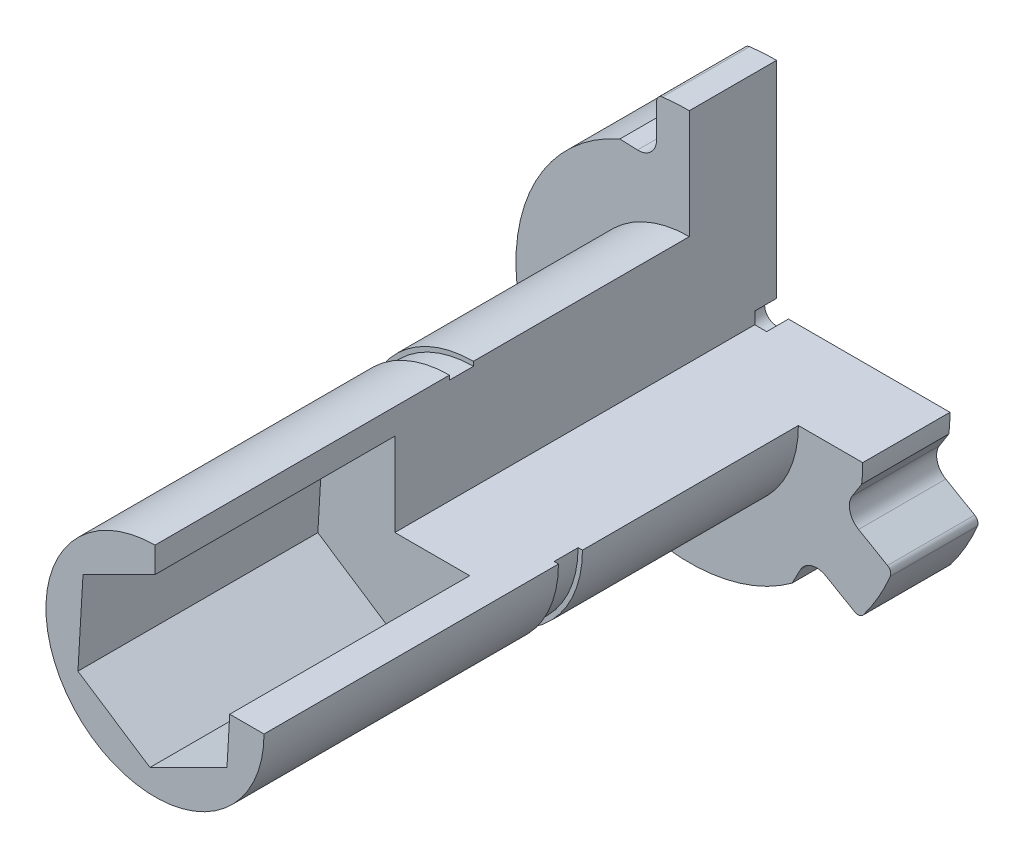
ISO-10303-21;
HEADER;
FILE_DESCRIPTION(('STEP AP214'),'2;1');
FILE_NAME('part.step','',(''),(''),'','','');
FILE_SCHEMA(('AUTOMOTIVE_DESIGN { 1 0 10303 214 1 1 1 1 }'));
ENDSEC;
DATA;
#1=APPLICATION_CONTEXT('core data for automotive mechanical design processes');
#2=APPLICATION_PROTOCOL_DEFINITION('international standard','automotive_design',2000,#1);
#3=PRODUCT_CONTEXT('',#1,'mechanical');
#4=PRODUCT('Part','Part','',(#3));
#5=PRODUCT_RELATED_PRODUCT_CATEGORY('part','',(#4));
#6=PRODUCT_DEFINITION_FORMATION('','',#4);
#7=PRODUCT_DEFINITION_CONTEXT('part definition',#1,'design');
#8=PRODUCT_DEFINITION('design','',#6,#7);
#9=PRODUCT_DEFINITION_SHAPE('','',#8);
#10=(LENGTH_UNIT() NAMED_UNIT(*) SI_UNIT(.MILLI.,.METRE.));
#11=(NAMED_UNIT(*) PLANE_ANGLE_UNIT() SI_UNIT($,.RADIAN.));
#12=(NAMED_UNIT(*) SI_UNIT($,.STERADIAN.) SOLID_ANGLE_UNIT());
#13=UNCERTAINTY_MEASURE_WITH_UNIT(LENGTH_MEASURE(1.E-05),#10,'distance_accuracy_value','');
#14=(GEOMETRIC_REPRESENTATION_CONTEXT(3) GLOBAL_UNCERTAINTY_ASSIGNED_CONTEXT((#13)) GLOBAL_UNIT_ASSIGNED_CONTEXT((#10,
#11,#12)) REPRESENTATION_CONTEXT('',''));
#15=CARTESIAN_POINT('',(0.,0.,0.));
#16=DIRECTION('',(0.,0.,1.));
#17=DIRECTION('',(1.,0.,0.));
#18=AXIS2_PLACEMENT_3D('',#15,#16,#17);
#19=CARTESIAN_POINT('',(0.,0.,24.5));
#20=DIRECTION('',(0.,0.,-1.));
#21=DIRECTION('',(-1.,0.,0.));
#22=AXIS2_PLACEMENT_3D('',#19,#20,#21);
#23=CYLINDRICAL_SURFACE('',#22,5.);
#24=DIRECTION('',(0.,0.,-1.));
#25=VECTOR('',#24,1.);
#26=CARTESIAN_POINT('',(5.,0.,24.5));
#27=LINE('',#26,#25);
#28=CARTESIAN_POINT('',(5.,0.,9.9));
#29=VERTEX_POINT('',#28);
#30=CARTESIAN_POINT('',(5.,0.,0.));
#31=VERTEX_POINT('',#30);
#32=EDGE_CURVE('E420',#29,#31,#27,.T.);
#33=ORIENTED_EDGE('',*,*,#32,.F.);
#34=CARTESIAN_POINT('',(0.,0.,9.9));
#35=DIRECTION('',(0.,0.,1.));
#36=DIRECTION('',(1.,0.,0.));
#37=AXIS2_PLACEMENT_3D('',#34,#35,#36);
#38=CIRCLE('',#37,5.);
#39=CARTESIAN_POINT('',(0.,5.,9.9));
#40=VERTEX_POINT('',#39);
#41=EDGE_CURVE('E442',#40,#29,#38,.T.);
#42=ORIENTED_EDGE('',*,*,#41,.F.);
#43=DIRECTION('',(0.,0.,-1.));
#44=VECTOR('',#43,1.);
#45=CARTESIAN_POINT('',(0.,5.,24.5));
#46=LINE('',#45,#44);
#47=CARTESIAN_POINT('',(0.,5.,0.));
#48=VERTEX_POINT('',#47);
#49=EDGE_CURVE('E700',#48,#40,#46,.F.);
#50=ORIENTED_EDGE('',*,*,#49,.F.);
#51=CARTESIAN_POINT('',(0.,0.,0.));
#52=DIRECTION('',(0.,0.,-1.));
#53=DIRECTION('',(-1.,0.,0.));
#54=AXIS2_PLACEMENT_3D('',#51,#52,#53);
#55=CIRCLE('',#54,5.);
#56=EDGE_CURVE('E585',#31,#48,#55,.T.);
#57=ORIENTED_EDGE('',*,*,#56,.F.);
#58=EDGE_LOOP('',(#33,#42,#50,#57));
#59=FACE_BOUND('',#58,.T.);
#60=ADVANCED_FACE('F115',(#59),#23,.T.);
#61=CARTESIAN_POINT('',(0.,0.,0.));
#62=DIRECTION('',(0.,0.,-1.));
#63=DIRECTION('',(-1.,0.,0.));
#64=AXIS2_PLACEMENT_3D('',#61,#62,#63);
#65=PLANE('',#64);
#66=DIRECTION('',(1.,0.,0.));
#67=VECTOR('',#66,1.);
#68=CARTESIAN_POINT('',(0.,0.,0.));
#69=LINE('',#68,#67);
#70=CARTESIAN_POINT('',(7.95,0.,0.));
#71=VERTEX_POINT('',#70);
#72=EDGE_CURVE('E422',#31,#71,#69,.T.);
#73=ORIENTED_EDGE('',*,*,#72,.F.);
#74=ORIENTED_EDGE('',*,*,#56,.T.);
#75=DIRECTION('',(0.,-1.,0.));
#76=VECTOR('',#75,1.);
#77=CARTESIAN_POINT('',(0.,0.,0.));
#78=LINE('',#77,#76);
#79=CARTESIAN_POINT('',(0.,10.,0.));
#80=VERTEX_POINT('',#79);
#81=EDGE_CURVE('E736',#80,#48,#78,.T.);
#82=ORIENTED_EDGE('',*,*,#81,.F.);
#83=CARTESIAN_POINT('',(0.,0.,0.));
#84=DIRECTION('',(0.,0.,-1.));
#85=DIRECTION('',(-1.,0.,0.));
#86=AXIS2_PLACEMENT_3D('',#83,#84,#85);
#87=CIRCLE('',#86,10.);
#88=CARTESIAN_POINT('',(-1.23711340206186,9.92318247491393,0.));
#89=VERTEX_POINT('',#88);
#90=EDGE_CURVE('E581',#89,#80,#87,.T.);
#91=ORIENTED_EDGE('',*,*,#90,.F.);
#92=CARTESIAN_POINT('',(-1.2,9.62548700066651,0.));
#93=DIRECTION('',(0.,0.,-1.));
#94=DIRECTION('',(-1.,0.,0.));
#95=AXIS2_PLACEMENT_3D('',#92,#93,#94);
#96=CIRCLE('',#95,0.3);
#97=CARTESIAN_POINT('',(-1.5,9.62548700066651,0.));
#98=VERTEX_POINT('',#97);
#99=EDGE_CURVE('E645',#89,#98,#96,.F.);
#100=ORIENTED_EDGE('',*,*,#99,.T.);
#101=DIRECTION('',(0.,-1.,0.));
#102=VECTOR('',#101,1.);
#103=CARTESIAN_POINT('',(-1.5,0.,0.));
#104=LINE('',#103,#102);
#105=CARTESIAN_POINT('',(-1.5,8.09309769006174,0.));
#106=VERTEX_POINT('',#105);
#107=EDGE_CURVE('E559',#98,#106,#104,.T.);
#108=ORIENTED_EDGE('',*,*,#107,.T.);
#109=CARTESIAN_POINT('',(-2.34249622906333,8.09309769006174,0.));
#110=DIRECTION('',(0.,0.,-1.));
#111=DIRECTION('',(-1.,0.,0.));
#112=AXIS2_PLACEMENT_3D('',#109,#110,#111);
#113=CIRCLE('',#112,0.842496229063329);
#114=CARTESIAN_POINT('',(-2.37659488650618,7.25129178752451,0.));
#115=VERTEX_POINT('',#114);
#116=EDGE_CURVE('E556',#106,#115,#113,.T.);
#117=ORIENTED_EDGE('',*,*,#116,.T.);
#118=DIRECTION('',(-0.999180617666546,0.0404733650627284,0.));
#119=VECTOR('',#118,1.);
#120=CARTESIAN_POINT('',(0.289350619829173,7.1433035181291,0.));
#121=LINE('',#120,#119);
#122=CARTESIAN_POINT('',(-3.18515413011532,7.28404373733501,0.));
#123=VERTEX_POINT('',#122);
#124=EDGE_CURVE('E553',#115,#123,#121,.T.);
#125=ORIENTED_EDGE('',*,*,#124,.T.);
#126=CARTESIAN_POINT('',(0.,0.,0.));
#127=DIRECTION('',(0.,0.,-1.));
#128=DIRECTION('',(-1.,0.,0.));
#129=AXIS2_PLACEMENT_3D('',#126,#127,#128);
#130=CIRCLE('',#129,7.95);
#131=CARTESIAN_POINT('',(-7.90074398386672,-0.883597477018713,0.));
#132=VERTEX_POINT('',#131);
#133=EDGE_CURVE('E551',#132,#123,#130,.T.);
#134=ORIENTED_EDGE('',*,*,#133,.F.);
#135=DIRECTION('',(-0.534641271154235,0.845079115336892,0.));
#136=VECTOR('',#135,1.);
#137=CARTESIAN_POINT('',(-6.04160700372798,-3.82223674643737,0.));
#138=LINE('',#137,#136);
#139=CARTESIAN_POINT('',(-7.46810034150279,-1.5674543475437,0.));
#140=VERTEX_POINT('',#139);
#141=EDGE_CURVE('E549',#140,#132,#138,.T.);
#142=ORIENTED_EDGE('',*,*,#141,.F.);
#143=CARTESIAN_POINT('',(-8.18007630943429,-2.01788760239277,0.));
#144=DIRECTION('',(0.,0.,-1.));
#145=DIRECTION('',(-1.,0.,0.));
#146=AXIS2_PLACEMENT_3D('',#143,#144,#145);
#147=CIRCLE('',#146,0.842496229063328);
#148=CARTESIAN_POINT('',(-7.75882819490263,-2.74751073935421,0.));
#149=VERTEX_POINT('',#148);
#150=EDGE_CURVE('E547',#149,#140,#147,.F.);
#151=ORIENTED_EDGE('',*,*,#150,.F.);
#152=DIRECTION('',(0.866025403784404,0.50000000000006,0.));
#153=VECTOR('',#152,1.);
#154=CARTESIAN_POINT('',(-0.750000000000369,1.29903810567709,0.));
#155=LINE('',#154,#153);
#156=CARTESIAN_POINT('',(-9.08591626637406,-3.51370539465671,0.));
#157=VERTEX_POINT('',#156);
#158=EDGE_CURVE('E545',#157,#149,#155,.T.);
#159=ORIENTED_EDGE('',*,*,#158,.F.);
#160=CARTESIAN_POINT('',(-8.93591626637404,-3.77351301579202,0.));
#161=DIRECTION('',(0.,0.,-1.));
#162=DIRECTION('',(-1.,0.,0.));
#163=AXIS2_PLACEMENT_3D('',#160,#161,#162);
#164=CIRCLE('',#163,0.3);
#165=CARTESIAN_POINT('',(-9.21228481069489,-3.8902196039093,0.));
#166=VERTEX_POINT('',#165);
#167=EDGE_CURVE('E651',#157,#166,#164,.F.);
#168=ORIENTED_EDGE('',*,*,#167,.T.);
#169=CARTESIAN_POINT('',(-7.97517140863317,-6.0329628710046,0.));
#170=VERTEX_POINT('',#169);
#171=EDGE_CURVE('E577',#170,#166,#87,.T.);
#172=ORIENTED_EDGE('',*,*,#171,.F.);
#173=CARTESIAN_POINT('',(-7.73591626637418,-5.85197398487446,0.));
#174=DIRECTION('',(0.,0.,-1.));
#175=DIRECTION('',(-1.,0.,0.));
#176=AXIS2_PLACEMENT_3D('',#173,#174,#175);
#177=CIRCLE('',#176,0.3);
#178=CARTESIAN_POINT('',(-7.58591626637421,-6.1117816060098,0.));
#179=VERTEX_POINT('',#178);
#180=EDGE_CURVE('E649',#170,#179,#177,.F.);
#181=ORIENTED_EDGE('',*,*,#180,.T.);
#182=DIRECTION('',(0.866025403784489,0.499999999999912,0.));
#183=VECTOR('',#182,1.);
#184=CARTESIAN_POINT('',(0.750000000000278,-1.29903810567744,0.));
#185=LINE('',#184,#183);
#186=CARTESIAN_POINT('',(-6.25882819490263,-5.34558695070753,0.));
#187=VERTEX_POINT('',#186);
#188=EDGE_CURVE('E543',#179,#187,#185,.T.);
#189=ORIENTED_EDGE('',*,*,#188,.T.);
#190=CARTESIAN_POINT('',(-5.83758008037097,-6.07521008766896,0.));
#191=DIRECTION('',(0.,0.,-1.));
#192=DIRECTION('',(-1.,0.,0.));
#193=AXIS2_PLACEMENT_3D('',#190,#191,#192);
#194=CIRCLE('',#193,0.842496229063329);
#195=CARTESIAN_POINT('',(-5.09150545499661,-5.68383743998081,0.));
#196=VERTEX_POINT('',#195);
#197=EDGE_CURVE('E540',#187,#196,#194,.T.);
#198=ORIENTED_EDGE('',*,*,#197,.T.);
#199=DIRECTION('',(0.464539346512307,-0.88555248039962,0.));
#200=VECTOR('',#199,1.);
#201=CARTESIAN_POINT('',(-6.33095762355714,-3.3210667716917,0.));
#202=LINE('',#201,#200);
#203=CARTESIAN_POINT('',(-4.71558985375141,-6.4004462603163,0.));
#204=VERTEX_POINT('',#203);
#205=EDGE_CURVE('E537',#196,#204,#202,.T.);
#206=ORIENTED_EDGE('',*,*,#205,.T.);
#207=CARTESIAN_POINT('',(0.,0.,0.));
#208=DIRECTION('',(0.,0.,-1.));
#209=DIRECTION('',(-1.,0.,0.));
#210=AXIS2_PLACEMENT_3D('',#207,#208,#209);
#211=CIRCLE('',#210,7.95);
#212=CARTESIAN_POINT('',(4.7155898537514,-6.40044626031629,0.));
#213=VERTEX_POINT('',#212);
#214=EDGE_CURVE('E501',#213,#204,#211,.T.);
#215=ORIENTED_EDGE('',*,*,#214,.F.);
#216=DIRECTION('',(-0.464539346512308,-0.885552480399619,0.));
#217=VECTOR('',#216,1.);
#218=CARTESIAN_POINT('',(6.33095762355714,-3.32106677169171,0.));
#219=LINE('',#218,#217);
#220=CARTESIAN_POINT('',(5.0915054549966,-5.68383743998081,0.));
#221=VERTEX_POINT('',#220);
#222=EDGE_CURVE('E575',#221,#213,#219,.T.);
#223=ORIENTED_EDGE('',*,*,#222,.F.);
#224=CARTESIAN_POINT('',(5.83758008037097,-6.07521008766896,0.));
#225=DIRECTION('',(0.,0.,-1.));
#226=DIRECTION('',(-1.,0.,0.));
#227=AXIS2_PLACEMENT_3D('',#224,#225,#226);
#228=CIRCLE('',#227,0.842496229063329);
#229=CARTESIAN_POINT('',(6.25882819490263,-5.34558695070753,0.));
#230=VERTEX_POINT('',#229);
#231=EDGE_CURVE('E573',#230,#221,#228,.F.);
#232=ORIENTED_EDGE('',*,*,#231,.F.);
#233=DIRECTION('',(-0.866025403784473,0.499999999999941,0.));
#234=VECTOR('',#233,1.);
#235=CARTESIAN_POINT('',(-0.750000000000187,-1.29903810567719,0.));
#236=LINE('',#235,#234);
#237=CARTESIAN_POINT('',(7.58591626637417,-6.11178160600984,0.));
#238=VERTEX_POINT('',#237);
#239=EDGE_CURVE('E571',#238,#230,#236,.T.);
#240=ORIENTED_EDGE('',*,*,#239,.F.);
#241=CARTESIAN_POINT('',(7.73591626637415,-5.8519739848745,0.));
#242=DIRECTION('',(0.,0.,-1.));
#243=DIRECTION('',(-1.,0.,0.));
#244=AXIS2_PLACEMENT_3D('',#241,#242,#243);
#245=CIRCLE('',#244,0.3);
#246=CARTESIAN_POINT('',(7.97517140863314,-6.03296287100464,0.));
#247=VERTEX_POINT('',#246);
#248=EDGE_CURVE('E647',#238,#247,#245,.F.);
#249=ORIENTED_EDGE('',*,*,#248,.T.);
#250=CARTESIAN_POINT('',(9.21228481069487,-3.89021960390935,0.));
#251=VERTEX_POINT('',#250);
#252=EDGE_CURVE('E580',#251,#247,#87,.T.);
#253=ORIENTED_EDGE('',*,*,#252,.F.);
#254=CARTESIAN_POINT('',(8.93591626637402,-3.77351301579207,0.));
#255=DIRECTION('',(0.,0.,-1.));
#256=DIRECTION('',(-1.,0.,0.));
#257=AXIS2_PLACEMENT_3D('',#254,#255,#256);
#258=CIRCLE('',#257,0.3);
#259=CARTESIAN_POINT('',(9.08591626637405,-3.51370539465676,0.));
#260=VERTEX_POINT('',#259);
#261=EDGE_CURVE('E653',#251,#260,#258,.F.);
#262=ORIENTED_EDGE('',*,*,#261,.T.);
#263=DIRECTION('',(-0.866025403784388,0.500000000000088,0.));
#264=VECTOR('',#263,1.);
#265=CARTESIAN_POINT('',(0.750000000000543,1.29903810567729,0.));
#266=LINE('',#265,#264);
#267=CARTESIAN_POINT('',(7.75882819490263,-2.74751073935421,0.));
#268=VERTEX_POINT('',#267);
#269=EDGE_CURVE('E569',#260,#268,#266,.T.);
#270=ORIENTED_EDGE('',*,*,#269,.T.);
#271=CARTESIAN_POINT('',(8.18007630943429,-2.01788760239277,0.));
#272=DIRECTION('',(0.,0.,-1.));
#273=DIRECTION('',(-1.,0.,0.));
#274=AXIS2_PLACEMENT_3D('',#271,#272,#273);
#275=CIRCLE('',#274,0.842496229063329);
#276=CARTESIAN_POINT('',(7.46810034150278,-1.56745434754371,0.));
#277=VERTEX_POINT('',#276);
#278=EDGE_CURVE('E566',#268,#277,#275,.T.);
#279=ORIENTED_EDGE('',*,*,#278,.T.);
#280=DIRECTION('',(0.53464127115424,0.845079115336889,0.));
#281=VECTOR('',#280,1.);
#282=CARTESIAN_POINT('',(6.04160700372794,-3.8222367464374,0.));
#283=LINE('',#282,#281);
#284=CARTESIAN_POINT('',(7.90074398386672,-0.883597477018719,0.));
#285=VERTEX_POINT('',#284);
#286=EDGE_CURVE('E563',#277,#285,#283,.T.);
#287=ORIENTED_EDGE('',*,*,#286,.T.);
#288=CARTESIAN_POINT('',(0.,0.,0.));
#289=DIRECTION('',(0.,0.,-1.));
#290=DIRECTION('',(-1.,0.,0.));
#291=AXIS2_PLACEMENT_3D('',#288,#289,#290);
#292=CIRCLE('',#291,7.95);
#293=EDGE_CURVE('E561',#71,#285,#292,.T.);
#294=ORIENTED_EDGE('',*,*,#293,.F.);
#295=EDGE_LOOP('',(#73,#74,#82,#91,#100,#108,#117,#125,#134,#142,#151,#159,#168,#172,#181,#189,
#198,#206,#215,#223,#232,#240,#249,#253,#262,#270,#279,#287,#294));
#296=FACE_BOUND('',#295,.T.);
#297=ADVANCED_FACE('F704',(#296),#65,.F.);
#298=CARTESIAN_POINT('',(0.,0.,-4.));
#299=DIRECTION('',(0.,0.,1.));
#300=DIRECTION('',(1.,0.,0.));
#301=AXIS2_PLACEMENT_3D('',#298,#299,#300);
#302=CYLINDRICAL_SURFACE('',#301,10.);
#303=DIRECTION('',(0.,0.,1.));
#304=VECTOR('',#303,1.);
#305=CARTESIAN_POINT('',(0.,10.,-4.));
#306=LINE('',#305,#304);
#307=CARTESIAN_POINT('',(0.,10.,-4.));
#308=VERTEX_POINT('',#307);
#309=EDGE_CURVE('E734',#308,#80,#306,.T.);
#310=ORIENTED_EDGE('',*,*,#309,.F.);
#311=CARTESIAN_POINT('',(0.,0.,-4.));
#312=DIRECTION('',(0.,0.,-1.));
#313=DIRECTION('',(-1.,0.,0.));
#314=AXIS2_PLACEMENT_3D('',#311,#312,#313);
#315=CIRCLE('',#314,10.);
#316=CARTESIAN_POINT('',(-1.23711340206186,9.92318247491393,-4.));
#317=VERTEX_POINT('',#316);
#318=EDGE_CURVE('E582',#317,#308,#315,.T.);
#319=ORIENTED_EDGE('',*,*,#318,.F.);
#320=DIRECTION('',(0.,0.,1.));
#321=VECTOR('',#320,1.);
#322=CARTESIAN_POINT('',(-1.23711340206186,9.92318247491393,-4.));
#323=LINE('',#322,#321);
#324=EDGE_CURVE('E666',#317,#89,#323,.T.);
#325=ORIENTED_EDGE('',*,*,#324,.T.);
#326=ORIENTED_EDGE('',*,*,#90,.T.);
#327=EDGE_LOOP('',(#310,#319,#325,#326));
#328=FACE_BOUND('',#327,.T.);
#329=ADVANCED_FACE('F747',(#328),#302,.T.);
#330=CARTESIAN_POINT('',(0.,0.,-4.));
#331=DIRECTION('',(0.,0.,-1.));
#332=DIRECTION('',(-1.,0.,0.));
#333=AXIS2_PLACEMENT_3D('',#330,#331,#332);
#334=PLANE('',#333);
#335=CARTESIAN_POINT('',(0.,0.,-4.));
#336=DIRECTION('',(0.,0.,-1.));
#337=DIRECTION('',(-1.,0.,0.));
#338=AXIS2_PLACEMENT_3D('',#335,#336,#337);
#339=CIRCLE('',#338,0.545651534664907);
#340=CARTESIAN_POINT('',(0.545651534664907,0.,-4.));
#341=VERTEX_POINT('',#340);
#342=CARTESIAN_POINT('',(0.,0.545651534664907,-4.));
#343=VERTEX_POINT('',#342);
#344=EDGE_CURVE('E445',#341,#343,#339,.T.);
#345=ORIENTED_EDGE('',*,*,#344,.F.);
#346=DIRECTION('',(1.,0.,0.));
#347=VECTOR('',#346,1.);
#348=CARTESIAN_POINT('',(0.,0.,-4.));
#349=LINE('',#348,#347);
#350=CARTESIAN_POINT('',(7.95,0.,-4.));
#351=VERTEX_POINT('',#350);
#352=EDGE_CURVE('E427',#341,#351,#349,.T.);
#353=ORIENTED_EDGE('',*,*,#352,.T.);
#354=CARTESIAN_POINT('',(0.,0.,-4.));
#355=DIRECTION('',(0.,0.,-1.));
#356=DIRECTION('',(-1.,0.,0.));
#357=AXIS2_PLACEMENT_3D('',#354,#355,#356);
#358=CIRCLE('',#357,7.95);
#359=CARTESIAN_POINT('',(7.90074398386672,-0.883597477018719,-4.));
#360=VERTEX_POINT('',#359);
#361=EDGE_CURVE('E483',#351,#360,#358,.T.);
#362=ORIENTED_EDGE('',*,*,#361,.T.);
#363=DIRECTION('',(0.53464127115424,0.845079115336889,0.));
#364=VECTOR('',#363,1.);
#365=CARTESIAN_POINT('',(-0.287325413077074,-13.826044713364,-4.));
#366=LINE('',#365,#364);
#367=CARTESIAN_POINT('',(7.46810034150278,-1.56745434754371,-4.));
#368=VERTEX_POINT('',#367);
#369=EDGE_CURVE('E485',#368,#360,#366,.T.);
#370=ORIENTED_EDGE('',*,*,#369,.F.);
#371=CARTESIAN_POINT('',(8.18007630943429,-2.01788760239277,-4.));
#372=DIRECTION('',(0.,0.,-1.));
#373=DIRECTION('',(-1.,0.,0.));
#374=AXIS2_PLACEMENT_3D('',#371,#372,#373);
#375=CIRCLE('',#374,0.842496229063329);
#376=CARTESIAN_POINT('',(7.75882819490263,-2.74751073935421,-4.));
#377=VERTEX_POINT('',#376);
#378=EDGE_CURVE('E488',#377,#368,#375,.T.);
#379=ORIENTED_EDGE('',*,*,#378,.F.);
#380=DIRECTION('',(-0.866025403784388,0.500000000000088,0.));
#381=VECTOR('',#380,1.);
#382=CARTESIAN_POINT('',(-15.8560660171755,10.8865547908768,-4.));
#383=LINE('',#382,#381);
#384=CARTESIAN_POINT('',(9.08591626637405,-3.51370539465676,-4.));
#385=VERTEX_POINT('',#384);
#386=EDGE_CURVE('E491',#385,#377,#383,.T.);
#387=ORIENTED_EDGE('',*,*,#386,.F.);
#388=CARTESIAN_POINT('',(8.93591626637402,-3.77351301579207,-4.));
#389=DIRECTION('',(0.,0.,-1.));
#390=DIRECTION('',(-1.,0.,0.));
#391=AXIS2_PLACEMENT_3D('',#388,#389,#390);
#392=CIRCLE('',#391,0.3);
#393=CARTESIAN_POINT('',(9.21228481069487,-3.89021960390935,-4.));
#394=VERTEX_POINT('',#393);
#395=EDGE_CURVE('E638',#385,#394,#392,.T.);
#396=ORIENTED_EDGE('',*,*,#395,.T.);
#397=CARTESIAN_POINT('',(7.97517140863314,-6.03296287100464,-4.));
#398=VERTEX_POINT('',#397);
#399=EDGE_CURVE('E586',#394,#398,#315,.T.);
#400=ORIENTED_EDGE('',*,*,#399,.T.);
#401=CARTESIAN_POINT('',(7.73591626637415,-5.8519739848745,-4.));
#402=DIRECTION('',(0.,0.,-1.));
#403=DIRECTION('',(-1.,0.,0.));
#404=AXIS2_PLACEMENT_3D('',#401,#402,#403);
#405=CIRCLE('',#404,0.3);
#406=CARTESIAN_POINT('',(7.58591626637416,-6.11178160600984,-4.));
#407=VERTEX_POINT('',#406);
#408=EDGE_CURVE('E632',#398,#407,#405,.T.);
#409=ORIENTED_EDGE('',*,*,#408,.T.);
#410=DIRECTION('',(-0.866025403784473,0.499999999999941,0.));
#411=VECTOR('',#410,1.);
#412=CARTESIAN_POINT('',(-17.3560660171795,8.28847857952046,-4.));
#413=LINE('',#412,#411);
#414=CARTESIAN_POINT('',(6.25882819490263,-5.34558695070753,-4.));
#415=VERTEX_POINT('',#414);
#416=EDGE_CURVE('E493',#407,#415,#413,.T.);
#417=ORIENTED_EDGE('',*,*,#416,.T.);
#418=CARTESIAN_POINT('',(5.83758008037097,-6.07521008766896,-4.));
#419=DIRECTION('',(0.,0.,-1.));
#420=DIRECTION('',(-1.,0.,0.));
#421=AXIS2_PLACEMENT_3D('',#418,#419,#420);
#422=CIRCLE('',#421,0.842496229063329);
#423=CARTESIAN_POINT('',(5.0915054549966,-5.68383743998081,-4.));
#424=VERTEX_POINT('',#423);
#425=EDGE_CURVE('E495',#415,#424,#422,.F.);
#426=ORIENTED_EDGE('',*,*,#425,.T.);
#427=DIRECTION('',(-0.464539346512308,-0.885552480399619,0.));
#428=VECTOR('',#427,1.);
#429=CARTESIAN_POINT('',(1.55290964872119,-12.4294711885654,-4.));
#430=LINE('',#429,#428);
#431=CARTESIAN_POINT('',(4.7155898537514,-6.4004462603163,-4.));
#432=VERTEX_POINT('',#431);
#433=EDGE_CURVE('E451',#424,#432,#430,.T.);
#434=ORIENTED_EDGE('',*,*,#433,.T.);
#435=CARTESIAN_POINT('',(0.,0.,-4.));
#436=DIRECTION('',(0.,0.,-1.));
#437=DIRECTION('',(-1.,0.,0.));
#438=AXIS2_PLACEMENT_3D('',#435,#436,#437);
#439=CIRCLE('',#438,7.95);
#440=CARTESIAN_POINT('',(-4.71558985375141,-6.40044626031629,-4.));
#441=VERTEX_POINT('',#440);
#442=EDGE_CURVE('E454',#432,#441,#439,.T.);
#443=ORIENTED_EDGE('',*,*,#442,.T.);
#444=DIRECTION('',(0.464539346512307,-0.88555248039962,0.));
#445=VECTOR('',#444,1.);
#446=CARTESIAN_POINT('',(-11.1090055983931,5.78733764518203,-4.));
#447=LINE('',#446,#445);
#448=CARTESIAN_POINT('',(-5.09150545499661,-5.68383743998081,-4.));
#449=VERTEX_POINT('',#448);
#450=EDGE_CURVE('E457',#449,#441,#447,.T.);
#451=ORIENTED_EDGE('',*,*,#450,.F.);
#452=CARTESIAN_POINT('',(-5.83758008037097,-6.07521008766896,-4.));
#453=DIRECTION('',(0.,0.,-1.));
#454=DIRECTION('',(-1.,0.,0.));
#455=AXIS2_PLACEMENT_3D('',#452,#453,#454);
#456=CIRCLE('',#455,0.842496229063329);
#457=CARTESIAN_POINT('',(-6.25882819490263,-5.34558695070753,-4.));
#458=VERTEX_POINT('',#457);
#459=EDGE_CURVE('E459',#458,#449,#456,.T.);
#460=ORIENTED_EDGE('',*,*,#459,.F.);
#461=DIRECTION('',(0.866025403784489,0.499999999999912,0.));
#462=VECTOR('',#461,1.);
#463=CARTESIAN_POINT('',(-15.8560660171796,-10.8865547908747,-4.));
#464=LINE('',#463,#462);
#465=CARTESIAN_POINT('',(-7.5859162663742,-6.1117816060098,-4.));
#466=VERTEX_POINT('',#465);
#467=EDGE_CURVE('E462',#466,#458,#464,.T.);
#468=ORIENTED_EDGE('',*,*,#467,.F.);
#469=CARTESIAN_POINT('',(-7.73591626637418,-5.85197398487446,-4.));
#470=DIRECTION('',(0.,0.,-1.));
#471=DIRECTION('',(-1.,0.,0.));
#472=AXIS2_PLACEMENT_3D('',#469,#470,#471);
#473=CIRCLE('',#472,0.3);
#474=CARTESIAN_POINT('',(-7.97517140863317,-6.0329628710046,-4.));
#475=VERTEX_POINT('',#474);
#476=EDGE_CURVE('E634',#466,#475,#473,.T.);
#477=ORIENTED_EDGE('',*,*,#476,.T.);
#478=CARTESIAN_POINT('',(-9.21228481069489,-3.8902196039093,-4.));
#479=VERTEX_POINT('',#478);
#480=EDGE_CURVE('E587',#475,#479,#315,.T.);
#481=ORIENTED_EDGE('',*,*,#480,.T.);
#482=CARTESIAN_POINT('',(-8.93591626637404,-3.77351301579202,-4.));
#483=DIRECTION('',(0.,0.,-1.));
#484=DIRECTION('',(-1.,0.,0.));
#485=AXIS2_PLACEMENT_3D('',#482,#483,#484);
#486=CIRCLE('',#485,0.3);
#487=CARTESIAN_POINT('',(-9.08591626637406,-3.5137053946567,-4.));
#488=VERTEX_POINT('',#487);
#489=EDGE_CURVE('E636',#479,#488,#486,.T.);
#490=ORIENTED_EDGE('',*,*,#489,.T.);
#491=DIRECTION('',(0.866025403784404,0.50000000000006,0.));
#492=VECTOR('',#491,1.);
#493=CARTESIAN_POINT('',(-17.356066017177,-8.28847857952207,-4.));
#494=LINE('',#493,#492);
#495=CARTESIAN_POINT('',(-7.75882819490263,-2.74751073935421,-4.));
#496=VERTEX_POINT('',#495);
#497=EDGE_CURVE('E464',#488,#496,#494,.T.);
#498=ORIENTED_EDGE('',*,*,#497,.T.);
#499=CARTESIAN_POINT('',(-8.18007630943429,-2.01788760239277,-4.));
#500=DIRECTION('',(0.,0.,-1.));
#501=DIRECTION('',(-1.,0.,0.));
#502=AXIS2_PLACEMENT_3D('',#499,#500,#501);
#503=CIRCLE('',#502,0.842496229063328);
#504=CARTESIAN_POINT('',(-7.46810034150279,-1.5674543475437,-4.));
#505=VERTEX_POINT('',#504);
#506=EDGE_CURVE('E466',#496,#505,#503,.F.);
#507=ORIENTED_EDGE('',*,*,#506,.T.);
#508=DIRECTION('',(-0.534641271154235,0.845079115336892,0.));
#509=VECTOR('',#508,1.);
#510=CARTESIAN_POINT('',(-12.3705394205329,6.18157122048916,-4.));
#511=LINE('',#510,#509);
#512=CARTESIAN_POINT('',(-7.90074398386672,-0.883597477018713,-4.));
#513=VERTEX_POINT('',#512);
#514=EDGE_CURVE('E469',#505,#513,#511,.T.);
#515=ORIENTED_EDGE('',*,*,#514,.T.);
#516=CARTESIAN_POINT('',(0.,0.,-4.));
#517=DIRECTION('',(0.,0.,-1.));
#518=DIRECTION('',(-1.,0.,0.));
#519=AXIS2_PLACEMENT_3D('',#516,#517,#518);
#520=CIRCLE('',#519,7.95);
#521=CARTESIAN_POINT('',(-3.18515413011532,7.28404373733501,-4.));
#522=VERTEX_POINT('',#521);
#523=EDGE_CURVE('E472',#513,#522,#520,.T.);
#524=ORIENTED_EDGE('',*,*,#523,.T.);
#525=DIRECTION('',(-0.999180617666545,0.0404733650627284,0.));
#526=VECTOR('',#525,1.);
#527=CARTESIAN_POINT('',(-21.8158010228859,8.0387070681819,-4.));
#528=LINE('',#527,#526);
#529=CARTESIAN_POINT('',(-2.37659488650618,7.25129178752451,-4.));
#530=VERTEX_POINT('',#529);
#531=EDGE_CURVE('E475',#530,#522,#528,.T.);
#532=ORIENTED_EDGE('',*,*,#531,.F.);
#533=CARTESIAN_POINT('',(-2.34249622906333,8.09309769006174,-4.));
#534=DIRECTION('',(0.,0.,-1.));
#535=DIRECTION('',(-1.,0.,0.));
#536=AXIS2_PLACEMENT_3D('',#533,#534,#535);
#537=CIRCLE('',#536,0.842496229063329);
#538=CARTESIAN_POINT('',(-1.5,8.09309769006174,-4.));
#539=VERTEX_POINT('',#538);
#540=EDGE_CURVE('E478',#539,#530,#537,.T.);
#541=ORIENTED_EDGE('',*,*,#540,.F.);
#542=DIRECTION('',(0.,-1.,0.));
#543=VECTOR('',#542,1.);
#544=CARTESIAN_POINT('',(-1.5,0.,-4.));
#545=LINE('',#544,#543);
#546=CARTESIAN_POINT('',(-1.5,9.62548700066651,-4.));
#547=VERTEX_POINT('',#546);
#548=EDGE_CURVE('E481',#547,#539,#545,.T.);
#549=ORIENTED_EDGE('',*,*,#548,.F.);
#550=CARTESIAN_POINT('',(-1.2,9.62548700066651,-4.));
#551=DIRECTION('',(0.,0.,-1.));
#552=DIRECTION('',(-1.,0.,0.));
#553=AXIS2_PLACEMENT_3D('',#550,#551,#552);
#554=CIRCLE('',#553,0.3);
#555=EDGE_CURVE('E630',#547,#317,#554,.T.);
#556=ORIENTED_EDGE('',*,*,#555,.T.);
#557=ORIENTED_EDGE('',*,*,#318,.T.);
#558=DIRECTION('',(0.,-1.,0.));
#559=VECTOR('',#558,1.);
#560=CARTESIAN_POINT('',(0.,0.,-4.));
#561=LINE('',#560,#559);
#562=EDGE_CURVE('E730',#308,#343,#561,.T.);
#563=ORIENTED_EDGE('',*,*,#562,.T.);
#564=EDGE_LOOP('',(#345,#353,#362,#370,#379,#387,#396,#400,#409,#417,#426,#434,#443,#451,#460,
#468,#477,#481,#490,#498,#507,#515,#524,#532,#541,#549,#556,#557,#563));
#565=FACE_BOUND('',#564,.T.);
#566=ADVANCED_FACE('F717',(#565),#334,.T.);
#567=CARTESIAN_POINT('',(0.,0.,24.5));
#568=DIRECTION('',(0.,0.,-1.));
#569=DIRECTION('',(-1.,0.,0.));
#570=AXIS2_PLACEMENT_3D('',#567,#568,#569);
#571=CYLINDRICAL_SURFACE('',#570,7.95);
#572=ORIENTED_EDGE('',*,*,#361,.F.);
#573=DIRECTION('',(0.,0.,-1.));
#574=VECTOR('',#573,1.);
#575=CARTESIAN_POINT('',(7.95,0.,24.5));
#576=LINE('',#575,#574);
#577=EDGE_CURVE('E424',#351,#71,#576,.F.);
#578=ORIENTED_EDGE('',*,*,#577,.T.);
#579=ORIENTED_EDGE('',*,*,#293,.T.);
#580=DIRECTION('',(0.,0.,-1.));
#581=VECTOR('',#580,1.);
#582=CARTESIAN_POINT('',(7.90074398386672,-0.883597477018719,24.5));
#583=LINE('',#582,#581);
#584=EDGE_CURVE('E510',#285,#360,#583,.T.);
#585=ORIENTED_EDGE('',*,*,#584,.T.);
#586=EDGE_LOOP('',(#572,#578,#579,#585));
#587=FACE_BOUND('',#586,.T.);
#588=ADVANCED_FACE('F709',(#587),#571,.T.);
#589=CARTESIAN_POINT('',(0.,0.,-3.));
#590=DIRECTION('',(0.,0.,-1.));
#591=DIRECTION('',(-1.,0.,0.));
#592=AXIS2_PLACEMENT_3D('',#589,#590,#591);
#593=CYLINDRICAL_SURFACE('',#592,0.545651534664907);
#594=DIRECTION('',(0.,0.,-1.));
#595=VECTOR('',#594,1.);
#596=CARTESIAN_POINT('',(0.545651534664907,0.,-3.));
#597=LINE('',#596,#595);
#598=CARTESIAN_POINT('',(0.545651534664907,0.,-3.));
#599=VERTEX_POINT('',#598);
#600=EDGE_CURVE('E430',#341,#599,#597,.F.);
#601=ORIENTED_EDGE('',*,*,#600,.F.);
#602=ORIENTED_EDGE('',*,*,#344,.T.);
#603=DIRECTION('',(0.,0.,-1.));
#604=VECTOR('',#603,1.);
#605=CARTESIAN_POINT('',(0.,0.545651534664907,-3.));
#606=LINE('',#605,#604);
#607=CARTESIAN_POINT('',(0.,0.545651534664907,-3.));
#608=VERTEX_POINT('',#607);
#609=EDGE_CURVE('E725',#608,#343,#606,.T.);
#610=ORIENTED_EDGE('',*,*,#609,.F.);
#611=CARTESIAN_POINT('',(0.,0.,-3.));
#612=DIRECTION('',(0.,0.,-1.));
#613=DIRECTION('',(-1.,0.,0.));
#614=AXIS2_PLACEMENT_3D('',#611,#612,#613);
#615=CIRCLE('',#614,0.545651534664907);
#616=EDGE_CURVE('E448',#599,#608,#615,.T.);
#617=ORIENTED_EDGE('',*,*,#616,.F.);
#618=EDGE_LOOP('',(#601,#602,#610,#617));
#619=FACE_BOUND('',#618,.T.);
#620=ADVANCED_FACE('F723',(#619),#593,.F.);
#621=CARTESIAN_POINT('',(0.,0.,-3.));
#622=DIRECTION('',(0.,0.,-1.));
#623=DIRECTION('',(-1.,0.,0.));
#624=AXIS2_PLACEMENT_3D('',#621,#622,#623);
#625=PLANE('',#624);
#626=DIRECTION('',(0.,-1.,0.));
#627=VECTOR('',#626,1.);
#628=CARTESIAN_POINT('',(0.,0.,-3.));
#629=LINE('',#628,#627);
#630=CARTESIAN_POINT('',(0.,0.,-3.));
#631=VERTEX_POINT('',#630);
#632=EDGE_CURVE('E728',#608,#631,#629,.T.);
#633=ORIENTED_EDGE('',*,*,#632,.T.);
#634=DIRECTION('',(1.,0.,0.));
#635=VECTOR('',#634,1.);
#636=CARTESIAN_POINT('',(0.,0.,-3.));
#637=LINE('',#636,#635);
#638=EDGE_CURVE('E398',#631,#599,#637,.T.);
#639=ORIENTED_EDGE('',*,*,#638,.T.);
#640=ORIENTED_EDGE('',*,*,#616,.T.);
#641=EDGE_LOOP('',(#633,#639,#640));
#642=FACE_BOUND('',#641,.T.);
#643=ADVANCED_FACE('F727',(#642),#625,.T.);
#644=CARTESIAN_POINT('',(0.,0.,9.9));
#645=DIRECTION('',(0.,0.,1.));
#646=DIRECTION('',(1.,0.,0.));
#647=AXIS2_PLACEMENT_3D('',#644,#645,#646);
#648=PLANE('',#647);
#649=ORIENTED_EDGE('',*,*,#41,.T.);
#650=DIRECTION('',(-1.,0.,0.));
#651=VECTOR('',#650,1.);
#652=CARTESIAN_POINT('',(0.,0.,9.9));
#653=LINE('',#652,#651);
#654=CARTESIAN_POINT('',(4.8,0.,9.9));
#655=VERTEX_POINT('',#654);
#656=EDGE_CURVE('E417',#29,#655,#653,.T.);
#657=ORIENTED_EDGE('',*,*,#656,.T.);
#658=CARTESIAN_POINT('',(0.,0.,9.9));
#659=DIRECTION('',(0.,0.,1.));
#660=DIRECTION('',(1.,0.,0.));
#661=AXIS2_PLACEMENT_3D('',#658,#659,#660);
#662=CIRCLE('',#661,4.8);
#663=CARTESIAN_POINT('',(0.,4.8,9.9));
#664=VERTEX_POINT('',#663);
#665=EDGE_CURVE('E436',#664,#655,#662,.T.);
#666=ORIENTED_EDGE('',*,*,#665,.F.);
#667=DIRECTION('',(0.,1.,0.));
#668=VECTOR('',#667,1.);
#669=CARTESIAN_POINT('',(0.,0.,9.9));
#670=LINE('',#669,#668);
#671=EDGE_CURVE('E696',#664,#40,#670,.T.);
#672=ORIENTED_EDGE('',*,*,#671,.T.);
#673=EDGE_LOOP('',(#649,#657,#666,#672));
#674=FACE_BOUND('',#673,.T.);
#675=ADVANCED_FACE('F693',(#674),#648,.T.);
#676=CARTESIAN_POINT('',(0.,0.,11.));
#677=DIRECTION('',(0.,0.,1.));
#678=DIRECTION('',(1.,0.,0.));
#679=AXIS2_PLACEMENT_3D('',#676,#677,#678);
#680=PLANE('',#679);
#681=DIRECTION('',(-1.,0.,0.));
#682=VECTOR('',#681,1.);
#683=CARTESIAN_POINT('',(0.,0.,11.));
#684=LINE('',#683,#682);
#685=CARTESIAN_POINT('',(5.,0.,11.));
#686=VERTEX_POINT('',#685);
#687=CARTESIAN_POINT('',(4.8,0.,11.));
#688=VERTEX_POINT('',#687);
#689=EDGE_CURVE('E406',#686,#688,#684,.T.);
#690=ORIENTED_EDGE('',*,*,#689,.F.);
#691=CARTESIAN_POINT('',(0.,0.,11.));
#692=DIRECTION('',(0.,0.,1.));
#693=DIRECTION('',(1.,0.,0.));
#694=AXIS2_PLACEMENT_3D('',#691,#692,#693);
#695=CIRCLE('',#694,5.);
#696=CARTESIAN_POINT('',(0.,5.,11.));
#697=VERTEX_POINT('',#696);
#698=EDGE_CURVE('E439',#697,#686,#695,.T.);
#699=ORIENTED_EDGE('',*,*,#698,.F.);
#700=DIRECTION('',(0.,1.,0.));
#701=VECTOR('',#700,1.);
#702=CARTESIAN_POINT('',(0.,0.,11.));
#703=LINE('',#702,#701);
#704=CARTESIAN_POINT('',(0.,4.8,11.));
#705=VERTEX_POINT('',#704);
#706=EDGE_CURVE('E129',#705,#697,#703,.T.);
#707=ORIENTED_EDGE('',*,*,#706,.F.);
#708=CARTESIAN_POINT('',(0.,0.,11.));
#709=DIRECTION('',(0.,0.,1.));
#710=DIRECTION('',(1.,0.,0.));
#711=AXIS2_PLACEMENT_3D('',#708,#709,#710);
#712=CIRCLE('',#711,4.8);
#713=EDGE_CURVE('E433',#705,#688,#712,.T.);
#714=ORIENTED_EDGE('',*,*,#713,.T.);
#715=EDGE_LOOP('',(#690,#699,#707,#714));
#716=FACE_BOUND('',#715,.T.);
#717=ADVANCED_FACE('F684',(#716),#680,.F.);
#718=CARTESIAN_POINT('',(0.,0.,9.9));
#719=DIRECTION('',(0.,0.,1.));
#720=DIRECTION('',(1.,0.,0.));
#721=AXIS2_PLACEMENT_3D('',#718,#719,#720);
#722=CYLINDRICAL_SURFACE('',#721,4.8);
#723=ORIENTED_EDGE('',*,*,#665,.T.);
#724=DIRECTION('',(0.,0.,1.));
#725=VECTOR('',#724,1.);
#726=CARTESIAN_POINT('',(4.8,0.,9.9));
#727=LINE('',#726,#725);
#728=EDGE_CURVE('E409',#655,#688,#727,.T.);
#729=ORIENTED_EDGE('',*,*,#728,.T.);
#730=ORIENTED_EDGE('',*,*,#713,.F.);
#731=DIRECTION('',(0.,0.,1.));
#732=VECTOR('',#731,1.);
#733=CARTESIAN_POINT('',(0.,4.8,9.9));
#734=LINE('',#733,#732);
#735=EDGE_CURVE('E689',#705,#664,#734,.F.);
#736=ORIENTED_EDGE('',*,*,#735,.T.);
#737=EDGE_LOOP('',(#723,#729,#730,#736));
#738=FACE_BOUND('',#737,.T.);
#739=ADVANCED_FACE('F688',(#738),#722,.T.);
#740=CARTESIAN_POINT('',(3.30053300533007,-2.17302173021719,13.5));
#741=DIRECTION('',(0.,0.,1.));
#742=DIRECTION('',(1.,0.,0.));
#743=AXIS2_PLACEMENT_3D('',#740,#741,#742);
#744=PLANE('',#743);
#745=DIRECTION('',(0.0586148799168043,0.998280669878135,0.));
#746=VECTOR('',#745,1.);
#747=CARTESIAN_POINT('',(3.30053300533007,-2.17302173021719,13.5));
#748=LINE('',#747,#746);
#749=CARTESIAN_POINT('',(3.30053300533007,-2.17302173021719,13.5));
#750=VERTEX_POINT('',#749);
#751=CARTESIAN_POINT('',(3.42812378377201,0.,13.5));
#752=VERTEX_POINT('',#751);
#753=EDGE_CURVE('E405',#750,#752,#748,.T.);
#754=ORIENTED_EDGE('',*,*,#753,.T.);
#755=DIRECTION('',(-1.,0.,0.));
#756=VECTOR('',#755,1.);
#757=CARTESIAN_POINT('',(3.30053300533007,0.,13.5));
#758=LINE('',#757,#756);
#759=CARTESIAN_POINT('',(0.,0.,13.5));
#760=VERTEX_POINT('',#759);
#761=EDGE_CURVE('E395',#752,#760,#758,.T.);
#762=ORIENTED_EDGE('',*,*,#761,.T.);
#763=DIRECTION('',(0.,1.,0.));
#764=VECTOR('',#763,1.);
#765=CARTESIAN_POINT('',(0.,-2.17302173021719,13.5));
#766=LINE('',#765,#764);
#767=CARTESIAN_POINT('',(0.,3.82866612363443,13.5));
#768=VERTEX_POINT('',#767);
#769=EDGE_CURVE('E382',#760,#768,#766,.T.);
#770=ORIENTED_EDGE('',*,*,#769,.T.);
#771=DIRECTION('',(-0.893843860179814,-0.448378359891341,0.));
#772=VECTOR('',#771,1.);
#773=CARTESIAN_POINT('',(0.231625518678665,3.94485629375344,13.5));
#774=LINE('',#773,#772);
#775=CARTESIAN_POINT('',(-3.30053300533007,2.17302173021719,13.5));
#776=VERTEX_POINT('',#775);
#777=EDGE_CURVE('E606',#768,#776,#774,.T.);
#778=ORIENTED_EDGE('',*,*,#777,.T.);
#779=DIRECTION('',(-0.0586148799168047,-0.998280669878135,0.));
#780=VECTOR('',#779,1.);
#781=CARTESIAN_POINT('',(-3.30053300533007,2.17302173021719,13.5));
#782=LINE('',#781,#780);
#783=CARTESIAN_POINT('',(-3.53215852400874,-1.77183456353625,13.5));
#784=VERTEX_POINT('',#783);
#785=EDGE_CURVE('E608',#776,#784,#782,.T.);
#786=ORIENTED_EDGE('',*,*,#785,.T.);
#787=DIRECTION('',(0.83522898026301,-0.549902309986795,0.));
#788=VECTOR('',#787,1.);
#789=CARTESIAN_POINT('',(-3.53215852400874,-1.77183456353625,13.5));
#790=LINE('',#789,#788);
#791=CARTESIAN_POINT('',(-0.231625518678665,-3.94485629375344,13.5));
#792=VERTEX_POINT('',#791);
#793=EDGE_CURVE('E611',#784,#792,#790,.T.);
#794=ORIENTED_EDGE('',*,*,#793,.T.);
#795=DIRECTION('',(0.893843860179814,0.448378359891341,0.));
#796=VECTOR('',#795,1.);
#797=CARTESIAN_POINT('',(-0.231625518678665,-3.94485629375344,13.5));
#798=LINE('',#797,#796);
#799=EDGE_CURVE('E603',#792,#750,#798,.T.);
#800=ORIENTED_EDGE('',*,*,#799,.T.);
#801=EDGE_LOOP('',(#754,#762,#770,#778,#786,#794,#800));
#802=FACE_BOUND('',#801,.T.);
#803=ADVANCED_FACE('F402',(#802),#744,.T.);
#804=CARTESIAN_POINT('',(3.30053300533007,-2.17302173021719,13.5));
#805=DIRECTION('',(0.998280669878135,-0.0586148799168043,0.));
#806=DIRECTION('',(0.0586148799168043,0.998280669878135,0.));
#807=AXIS2_PLACEMENT_3D('',#804,#805,#806);
#808=PLANE('',#807);
#809=DIRECTION('',(0.,0.,1.));
#810=VECTOR('',#809,1.);
#811=CARTESIAN_POINT('',(3.42812378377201,0.,13.5));
#812=LINE('',#811,#810);
#813=CARTESIAN_POINT('',(3.42812378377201,0.,24.5));
#814=VERTEX_POINT('',#813);
#815=EDGE_CURVE('E407',#752,#814,#812,.T.);
#816=ORIENTED_EDGE('',*,*,#815,.F.);
#817=ORIENTED_EDGE('',*,*,#753,.F.);
#818=DIRECTION('',(0.,0.,1.));
#819=VECTOR('',#818,1.);
#820=CARTESIAN_POINT('',(3.30053300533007,-2.17302173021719,13.5));
#821=LINE('',#820,#819);
#822=CARTESIAN_POINT('',(3.30053300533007,-2.17302173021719,24.5));
#823=VERTEX_POINT('',#822);
#824=EDGE_CURVE('E614',#750,#823,#821,.T.);
#825=ORIENTED_EDGE('',*,*,#824,.T.);
#826=DIRECTION('',(0.0586148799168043,0.998280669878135,0.));
#827=VECTOR('',#826,1.);
#828=CARTESIAN_POINT('',(3.30053300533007,-2.17302173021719,24.5));
#829=LINE('',#828,#827);
#830=EDGE_CURVE('E592',#823,#814,#829,.T.);
#831=ORIENTED_EDGE('',*,*,#830,.T.);
#832=EDGE_LOOP('',(#816,#817,#825,#831));
#833=FACE_BOUND('',#832,.T.);
#834=ADVANCED_FACE('F870',(#833),#808,.F.);
#835=CARTESIAN_POINT('',(0.231625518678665,3.94485629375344,13.5));
#836=DIRECTION('',(-0.448378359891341,0.893843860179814,0.));
#837=DIRECTION('',(-0.893843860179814,-0.448378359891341,0.));
#838=AXIS2_PLACEMENT_3D('',#835,#836,#837);
#839=PLANE('',#838);
#840=DIRECTION('',(0.,0.,-1.));
#841=VECTOR('',#840,1.);
#842=CARTESIAN_POINT('',(0.,3.82866612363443,13.5));
#843=LINE('',#842,#841);
#844=CARTESIAN_POINT('',(0.,3.82866612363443,24.5));
#845=VERTEX_POINT('',#844);
#846=EDGE_CURVE('E388',#845,#768,#843,.T.);
#847=ORIENTED_EDGE('',*,*,#846,.F.);
#848=DIRECTION('',(-0.893843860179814,-0.448378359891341,0.));
#849=VECTOR('',#848,1.);
#850=CARTESIAN_POINT('',(0.231625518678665,3.94485629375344,24.5));
#851=LINE('',#850,#849);
#852=CARTESIAN_POINT('',(-3.30053300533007,2.17302173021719,24.5));
#853=VERTEX_POINT('',#852);
#854=EDGE_CURVE('E595',#845,#853,#851,.T.);
#855=ORIENTED_EDGE('',*,*,#854,.T.);
#856=DIRECTION('',(0.,0.,1.));
#857=VECTOR('',#856,1.);
#858=CARTESIAN_POINT('',(-3.30053300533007,2.17302173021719,13.5));
#859=LINE('',#858,#857);
#860=EDGE_CURVE('E620',#776,#853,#859,.T.);
#861=ORIENTED_EDGE('',*,*,#860,.F.);
#862=ORIENTED_EDGE('',*,*,#777,.F.);
#863=EDGE_LOOP('',(#847,#855,#861,#862));
#864=FACE_BOUND('',#863,.T.);
#865=ADVANCED_FACE('F866',(#864),#839,.F.);
#866=CARTESIAN_POINT('',(0.,0.,24.5));
#867=DIRECTION('',(0.,0.,1.));
#868=DIRECTION('',(1.,0.,0.));
#869=AXIS2_PLACEMENT_3D('',#866,#867,#868);
#870=PLANE('',#869);
#871=CARTESIAN_POINT('',(0.,0.,24.5));
#872=DIRECTION('',(0.,0.,1.));
#873=DIRECTION('',(1.,0.,0.));
#874=AXIS2_PLACEMENT_3D('',#871,#872,#873);
#875=CIRCLE('',#874,5.);
#876=CARTESIAN_POINT('',(0.,5.,24.5));
#877=VERTEX_POINT('',#876);
#878=CARTESIAN_POINT('',(5.,0.,24.5));
#879=VERTEX_POINT('',#878);
#880=EDGE_CURVE('E617',#877,#879,#875,.T.);
#881=ORIENTED_EDGE('',*,*,#880,.T.);
#882=DIRECTION('',(-1.,0.,0.));
#883=VECTOR('',#882,1.);
#884=CARTESIAN_POINT('',(0.,0.,24.5));
#885=LINE('',#884,#883);
#886=EDGE_CURVE('E411',#879,#814,#885,.T.);
#887=ORIENTED_EDGE('',*,*,#886,.T.);
#888=ORIENTED_EDGE('',*,*,#830,.F.);
#889=DIRECTION('',(0.893843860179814,0.448378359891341,0.));
#890=VECTOR('',#889,1.);
#891=CARTESIAN_POINT('',(-0.231625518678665,-3.94485629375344,24.5));
#892=LINE('',#891,#890);
#893=CARTESIAN_POINT('',(-0.231625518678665,-3.94485629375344,24.5));
#894=VERTEX_POINT('',#893);
#895=EDGE_CURVE('E590',#894,#823,#892,.T.);
#896=ORIENTED_EDGE('',*,*,#895,.F.);
#897=DIRECTION('',(0.83522898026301,-0.549902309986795,0.));
#898=VECTOR('',#897,1.);
#899=CARTESIAN_POINT('',(-3.53215852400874,-1.77183456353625,24.5));
#900=LINE('',#899,#898);
#901=CARTESIAN_POINT('',(-3.53215852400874,-1.77183456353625,24.5));
#902=VERTEX_POINT('',#901);
#903=EDGE_CURVE('E600',#902,#894,#900,.T.);
#904=ORIENTED_EDGE('',*,*,#903,.F.);
#905=DIRECTION('',(-0.0586148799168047,-0.998280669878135,0.));
#906=VECTOR('',#905,1.);
#907=CARTESIAN_POINT('',(-3.30053300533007,2.17302173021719,24.5));
#908=LINE('',#907,#906);
#909=EDGE_CURVE('E597',#853,#902,#908,.T.);
#910=ORIENTED_EDGE('',*,*,#909,.F.);
#911=ORIENTED_EDGE('',*,*,#854,.F.);
#912=DIRECTION('',(0.,1.,0.));
#913=VECTOR('',#912,1.);
#914=CARTESIAN_POINT('',(0.,0.,24.5));
#915=LINE('',#914,#913);
#916=EDGE_CURVE('E399',#845,#877,#915,.T.);
#917=ORIENTED_EDGE('',*,*,#916,.T.);
#918=EDGE_LOOP('',(#881,#887,#888,#896,#904,#910,#911,#917));
#919=FACE_BOUND('',#918,.T.);
#920=ADVANCED_FACE('F676',(#919),#870,.T.);
#921=DIRECTION('',(0.,0.,-1.));
#922=VECTOR('',#921,1.);
#923=CARTESIAN_POINT('',(5.,0.,24.5));
#924=LINE('',#923,#922);
#925=EDGE_CURVE('E13',#879,#686,#924,.T.);
#926=ORIENTED_EDGE('',*,*,#925,.F.);
#927=ORIENTED_EDGE('',*,*,#880,.F.);
#928=DIRECTION('',(0.,0.,-1.));
#929=VECTOR('',#928,1.);
#930=CARTESIAN_POINT('',(0.,5.,24.5));
#931=LINE('',#930,#929);
#932=EDGE_CURVE('E122',#697,#877,#931,.F.);
#933=ORIENTED_EDGE('',*,*,#932,.F.);
#934=ORIENTED_EDGE('',*,*,#698,.T.);
#935=EDGE_LOOP('',(#926,#927,#933,#934));
#936=FACE_BOUND('',#935,.T.);
#937=ADVANCED_FACE('F681',(#936),#23,.T.);
#938=ORIENTED_EDGE('',*,*,#399,.F.);
#939=DIRECTION('',(0.,0.,1.));
#940=VECTOR('',#939,1.);
#941=CARTESIAN_POINT('',(9.21228481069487,-3.89021960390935,-4.));
#942=LINE('',#941,#940);
#943=EDGE_CURVE('E643',#394,#251,#942,.T.);
#944=ORIENTED_EDGE('',*,*,#943,.T.);
#945=ORIENTED_EDGE('',*,*,#252,.T.);
#946=DIRECTION('',(0.,0.,1.));
#947=VECTOR('',#946,1.);
#948=CARTESIAN_POINT('',(7.97517140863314,-6.03296287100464,-4.));
#949=LINE('',#948,#947);
#950=EDGE_CURVE('E640',#247,#398,#949,.F.);
#951=ORIENTED_EDGE('',*,*,#950,.T.);
#952=EDGE_LOOP('',(#938,#944,#945,#951));
#953=FACE_BOUND('',#952,.T.);
#954=ADVANCED_FACE('F756',(#953),#302,.T.);
#955=ORIENTED_EDGE('',*,*,#171,.T.);
#956=DIRECTION('',(0.,0.,1.));
#957=VECTOR('',#956,1.);
#958=CARTESIAN_POINT('',(-9.21228481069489,-3.8902196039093,-4.));
#959=LINE('',#958,#957);
#960=EDGE_CURVE('E657',#166,#479,#959,.F.);
#961=ORIENTED_EDGE('',*,*,#960,.T.);
#962=ORIENTED_EDGE('',*,*,#480,.F.);
#963=DIRECTION('',(0.,0.,1.));
#964=VECTOR('',#963,1.);
#965=CARTESIAN_POINT('',(-7.97517140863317,-6.0329628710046,-4.));
#966=LINE('',#965,#964);
#967=EDGE_CURVE('E655',#475,#170,#966,.T.);
#968=ORIENTED_EDGE('',*,*,#967,.T.);
#969=EDGE_LOOP('',(#955,#961,#962,#968));
#970=FACE_BOUND('',#969,.T.);
#971=ADVANCED_FACE('F798',(#970),#302,.T.);
#972=CARTESIAN_POINT('',(0.,0.,24.5));
#973=DIRECTION('',(0.,0.,-1.));
#974=DIRECTION('',(-1.,0.,0.));
#975=AXIS2_PLACEMENT_3D('',#972,#973,#974);
#976=CYLINDRICAL_SURFACE('',#975,7.95);
#977=ORIENTED_EDGE('',*,*,#214,.T.);
#978=DIRECTION('',(0.,0.,-1.));
#979=VECTOR('',#978,1.);
#980=CARTESIAN_POINT('',(-4.71558985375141,-6.4004462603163,24.5));
#981=LINE('',#980,#979);
#982=EDGE_CURVE('E532',#204,#441,#981,.T.);
#983=ORIENTED_EDGE('',*,*,#982,.T.);
#984=ORIENTED_EDGE('',*,*,#442,.F.);
#985=DIRECTION('',(0.,0.,-1.));
#986=VECTOR('',#985,1.);
#987=CARTESIAN_POINT('',(4.7155898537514,-6.40044626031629,24.5));
#988=LINE('',#987,#986);
#989=EDGE_CURVE('E498',#213,#432,#988,.T.);
#990=ORIENTED_EDGE('',*,*,#989,.F.);
#991=EDGE_LOOP('',(#977,#983,#984,#990));
#992=FACE_BOUND('',#991,.T.);
#993=ADVANCED_FACE('F779',(#992),#976,.T.);
#994=CARTESIAN_POINT('',(-11.1090055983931,5.78733764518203,24.5));
#995=DIRECTION('',(0.88555248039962,0.464539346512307,0.));
#996=DIRECTION('',(-0.464539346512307,0.88555248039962,0.));
#997=AXIS2_PLACEMENT_3D('',#994,#995,#996);
#998=PLANE('',#997);
#999=DIRECTION('',(0.,0.,-1.));
#1000=VECTOR('',#999,1.);
#1001=CARTESIAN_POINT('',(-5.09150545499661,-5.68383743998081,24.5));
#1002=LINE('',#1001,#1000);
#1003=EDGE_CURVE('E530',#196,#449,#1002,.T.);
#1004=ORIENTED_EDGE('',*,*,#1003,.T.);
#1005=ORIENTED_EDGE('',*,*,#450,.T.);
#1006=ORIENTED_EDGE('',*,*,#982,.F.);
#1007=ORIENTED_EDGE('',*,*,#205,.F.);
#1008=EDGE_LOOP('',(#1004,#1005,#1006,#1007));
#1009=FACE_BOUND('',#1008,.T.);
#1010=ADVANCED_FACE('F782',(#1009),#998,.F.);
#1011=CARTESIAN_POINT('',(-5.83758008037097,-6.07521008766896,24.5));
#1012=DIRECTION('',(0.,0.,-1.));
#1013=DIRECTION('',(-1.,0.,0.));
#1014=AXIS2_PLACEMENT_3D('',#1011,#1012,#1013);
#1015=CYLINDRICAL_SURFACE('',#1014,0.842496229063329);
#1016=DIRECTION('',(0.,0.,-1.));
#1017=VECTOR('',#1016,1.);
#1018=CARTESIAN_POINT('',(-6.25882819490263,-5.34558695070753,24.5));
#1019=LINE('',#1018,#1017);
#1020=EDGE_CURVE('E527',#187,#458,#1019,.T.);
#1021=ORIENTED_EDGE('',*,*,#1020,.T.);
#1022=ORIENTED_EDGE('',*,*,#459,.T.);
#1023=ORIENTED_EDGE('',*,*,#1003,.F.);
#1024=ORIENTED_EDGE('',*,*,#197,.F.);
#1025=EDGE_LOOP('',(#1021,#1022,#1023,#1024));
#1026=FACE_BOUND('',#1025,.T.);
#1027=ADVANCED_FACE('F788',(#1026),#1015,.F.);
#1028=CARTESIAN_POINT('',(-15.8560660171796,-10.8865547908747,24.5));
#1029=DIRECTION('',(-0.499999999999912,0.866025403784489,0.));
#1030=DIRECTION('',(-0.866025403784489,-0.499999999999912,0.));
#1031=AXIS2_PLACEMENT_3D('',#1028,#1029,#1030);
#1032=PLANE('',#1031);
#1033=ORIENTED_EDGE('',*,*,#188,.F.);
#1034=DIRECTION('',(0.,0.,1.));
#1035=VECTOR('',#1034,1.);
#1036=CARTESIAN_POINT('',(-7.5859162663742,-6.1117816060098,24.5));
#1037=LINE('',#1036,#1035);
#1038=EDGE_CURVE('E662',#179,#466,#1037,.F.);
#1039=ORIENTED_EDGE('',*,*,#1038,.T.);
#1040=ORIENTED_EDGE('',*,*,#467,.T.);
#1041=ORIENTED_EDGE('',*,*,#1020,.F.);
#1042=EDGE_LOOP('',(#1033,#1039,#1040,#1041));
#1043=FACE_BOUND('',#1042,.T.);
#1044=ADVANCED_FACE('F791',(#1043),#1032,.F.);
#1045=CARTESIAN_POINT('',(-17.3560660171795,8.28847857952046,24.5));
#1046=DIRECTION('',(-0.499999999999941,-0.866025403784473,0.));
#1047=DIRECTION('',(0.866025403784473,-0.499999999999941,0.));
#1048=AXIS2_PLACEMENT_3D('',#1045,#1046,#1047);
#1049=PLANE('',#1048);
#1050=ORIENTED_EDGE('',*,*,#416,.F.);
#1051=DIRECTION('',(0.,0.,-1.));
#1052=VECTOR('',#1051,1.);
#1053=CARTESIAN_POINT('',(7.58591626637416,-6.11178160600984,0.));
#1054=LINE('',#1053,#1052);
#1055=EDGE_CURVE('E137',#407,#238,#1054,.F.);
#1056=ORIENTED_EDGE('',*,*,#1055,.T.);
#1057=ORIENTED_EDGE('',*,*,#239,.T.);
#1058=DIRECTION('',(0.,0.,-1.));
#1059=VECTOR('',#1058,1.);
#1060=CARTESIAN_POINT('',(6.25882819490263,-5.34558695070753,24.5));
#1061=LINE('',#1060,#1059);
#1062=EDGE_CURVE('E502',#230,#415,#1061,.T.);
#1063=ORIENTED_EDGE('',*,*,#1062,.T.);
#1064=EDGE_LOOP('',(#1050,#1056,#1057,#1063));
#1065=FACE_BOUND('',#1064,.T.);
#1066=ADVANCED_FACE('F763',(#1065),#1049,.T.);
#1067=CARTESIAN_POINT('',(5.83758008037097,-6.07521008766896,24.5));
#1068=DIRECTION('',(0.,0.,-1.));
#1069=DIRECTION('',(-1.,0.,0.));
#1070=AXIS2_PLACEMENT_3D('',#1067,#1068,#1069);
#1071=CYLINDRICAL_SURFACE('',#1070,0.842496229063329);
#1072=ORIENTED_EDGE('',*,*,#231,.T.);
#1073=DIRECTION('',(0.,0.,-1.));
#1074=VECTOR('',#1073,1.);
#1075=CARTESIAN_POINT('',(5.0915054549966,-5.68383743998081,24.5));
#1076=LINE('',#1075,#1074);
#1077=EDGE_CURVE('E499',#221,#424,#1076,.T.);
#1078=ORIENTED_EDGE('',*,*,#1077,.T.);
#1079=ORIENTED_EDGE('',*,*,#425,.F.);
#1080=ORIENTED_EDGE('',*,*,#1062,.F.);
#1081=EDGE_LOOP('',(#1072,#1078,#1079,#1080));
#1082=FACE_BOUND('',#1081,.T.);
#1083=ADVANCED_FACE('F768',(#1082),#1071,.F.);
#1084=CARTESIAN_POINT('',(1.55290964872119,-12.4294711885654,24.5));
#1085=DIRECTION('',(0.885552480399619,-0.464539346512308,0.));
#1086=DIRECTION('',(0.464539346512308,0.885552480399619,0.));
#1087=AXIS2_PLACEMENT_3D('',#1084,#1085,#1086);
#1088=PLANE('',#1087);
#1089=ORIENTED_EDGE('',*,*,#222,.T.);
#1090=ORIENTED_EDGE('',*,*,#989,.T.);
#1091=ORIENTED_EDGE('',*,*,#433,.F.);
#1092=ORIENTED_EDGE('',*,*,#1077,.F.);
#1093=EDGE_LOOP('',(#1089,#1090,#1091,#1092));
#1094=FACE_BOUND('',#1093,.T.);
#1095=ADVANCED_FACE('F774',(#1094),#1088,.T.);
#1096=CARTESIAN_POINT('',(-17.356066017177,-8.28847857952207,24.5));
#1097=DIRECTION('',(-0.50000000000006,0.866025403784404,0.));
#1098=DIRECTION('',(-0.866025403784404,-0.50000000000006,0.));
#1099=AXIS2_PLACEMENT_3D('',#1096,#1097,#1098);
#1100=PLANE('',#1099);
#1101=ORIENTED_EDGE('',*,*,#497,.F.);
#1102=DIRECTION('',(0.,0.,-1.));
#1103=VECTOR('',#1102,1.);
#1104=CARTESIAN_POINT('',(-9.08591626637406,-3.5137053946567,0.));
#1105=LINE('',#1104,#1103);
#1106=EDGE_CURVE('E660',#488,#157,#1105,.F.);
#1107=ORIENTED_EDGE('',*,*,#1106,.T.);
#1108=ORIENTED_EDGE('',*,*,#158,.T.);
#1109=DIRECTION('',(0.,0.,-1.));
#1110=VECTOR('',#1109,1.);
#1111=CARTESIAN_POINT('',(-7.75882819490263,-2.74751073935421,24.5));
#1112=LINE('',#1111,#1110);
#1113=EDGE_CURVE('E524',#149,#496,#1112,.T.);
#1114=ORIENTED_EDGE('',*,*,#1113,.T.);
#1115=EDGE_LOOP('',(#1101,#1107,#1108,#1114));
#1116=FACE_BOUND('',#1115,.T.);
#1117=ADVANCED_FACE('F811',(#1116),#1100,.T.);
#1118=CARTESIAN_POINT('',(-8.18007630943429,-2.01788760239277,24.5));
#1119=DIRECTION('',(0.,0.,-1.));
#1120=DIRECTION('',(-1.,0.,0.));
#1121=AXIS2_PLACEMENT_3D('',#1118,#1119,#1120);
#1122=CYLINDRICAL_SURFACE('',#1121,0.842496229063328);
#1123=ORIENTED_EDGE('',*,*,#150,.T.);
#1124=DIRECTION('',(0.,0.,-1.));
#1125=VECTOR('',#1124,1.);
#1126=CARTESIAN_POINT('',(-7.46810034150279,-1.5674543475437,24.5));
#1127=LINE('',#1126,#1125);
#1128=EDGE_CURVE('E522',#140,#505,#1127,.T.);
#1129=ORIENTED_EDGE('',*,*,#1128,.T.);
#1130=ORIENTED_EDGE('',*,*,#506,.F.);
#1131=ORIENTED_EDGE('',*,*,#1113,.F.);
#1132=EDGE_LOOP('',(#1123,#1129,#1130,#1131));
#1133=FACE_BOUND('',#1132,.T.);
#1134=ADVANCED_FACE('F815',(#1133),#1122,.F.);
#1135=CARTESIAN_POINT('',(-12.3705394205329,6.18157122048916,24.5));
#1136=DIRECTION('',(-0.845079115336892,-0.534641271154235,0.));
#1137=DIRECTION('',(0.534641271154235,-0.845079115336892,0.));
#1138=AXIS2_PLACEMENT_3D('',#1135,#1136,#1137);
#1139=PLANE('',#1138);
#1140=ORIENTED_EDGE('',*,*,#141,.T.);
#1141=DIRECTION('',(0.,0.,-1.));
#1142=VECTOR('',#1141,1.);
#1143=CARTESIAN_POINT('',(-7.90074398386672,-0.883597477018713,24.5));
#1144=LINE('',#1143,#1142);
#1145=EDGE_CURVE('E520',#132,#513,#1144,.T.);
#1146=ORIENTED_EDGE('',*,*,#1145,.T.);
#1147=ORIENTED_EDGE('',*,*,#514,.F.);
#1148=ORIENTED_EDGE('',*,*,#1128,.F.);
#1149=EDGE_LOOP('',(#1140,#1146,#1147,#1148));
#1150=FACE_BOUND('',#1149,.T.);
#1151=ADVANCED_FACE('F821',(#1150),#1139,.T.);
#1152=CARTESIAN_POINT('',(0.,0.,24.5));
#1153=DIRECTION('',(0.,0.,-1.));
#1154=DIRECTION('',(-1.,0.,0.));
#1155=AXIS2_PLACEMENT_3D('',#1152,#1153,#1154);
#1156=CYLINDRICAL_SURFACE('',#1155,7.95);
#1157=ORIENTED_EDGE('',*,*,#133,.T.);
#1158=DIRECTION('',(0.,0.,-1.));
#1159=VECTOR('',#1158,1.);
#1160=CARTESIAN_POINT('',(-3.18515413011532,7.28404373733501,24.5));
#1161=LINE('',#1160,#1159);
#1162=EDGE_CURVE('E518',#123,#522,#1161,.T.);
#1163=ORIENTED_EDGE('',*,*,#1162,.T.);
#1164=ORIENTED_EDGE('',*,*,#523,.F.);
#1165=ORIENTED_EDGE('',*,*,#1145,.F.);
#1166=EDGE_LOOP('',(#1157,#1163,#1164,#1165));
#1167=FACE_BOUND('',#1166,.T.);
#1168=ADVANCED_FACE('F825',(#1167),#1156,.T.);
#1169=CARTESIAN_POINT('',(-21.8158010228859,8.0387070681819,24.5));
#1170=DIRECTION('',(-0.0404733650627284,-0.999180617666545,0.));
#1171=DIRECTION('',(0.999180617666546,-0.0404733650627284,0.));
#1172=AXIS2_PLACEMENT_3D('',#1169,#1170,#1171);
#1173=PLANE('',#1172);
#1174=DIRECTION('',(0.,0.,-1.));
#1175=VECTOR('',#1174,1.);
#1176=CARTESIAN_POINT('',(-2.37659488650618,7.25129178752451,24.5));
#1177=LINE('',#1176,#1175);
#1178=EDGE_CURVE('E516',#115,#530,#1177,.T.);
#1179=ORIENTED_EDGE('',*,*,#1178,.T.);
#1180=ORIENTED_EDGE('',*,*,#531,.T.);
#1181=ORIENTED_EDGE('',*,*,#1162,.F.);
#1182=ORIENTED_EDGE('',*,*,#124,.F.);
#1183=EDGE_LOOP('',(#1179,#1180,#1181,#1182));
#1184=FACE_BOUND('',#1183,.T.);
#1185=ADVANCED_FACE('F831',(#1184),#1173,.F.);
#1186=CARTESIAN_POINT('',(-2.34249622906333,8.09309769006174,24.5));
#1187=DIRECTION('',(0.,0.,-1.));
#1188=DIRECTION('',(-1.,0.,0.));
#1189=AXIS2_PLACEMENT_3D('',#1186,#1187,#1188);
#1190=CYLINDRICAL_SURFACE('',#1189,0.842496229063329);
#1191=DIRECTION('',(0.,0.,-1.));
#1192=VECTOR('',#1191,1.);
#1193=CARTESIAN_POINT('',(-1.5,8.09309769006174,24.5));
#1194=LINE('',#1193,#1192);
#1195=EDGE_CURVE('E513',#106,#539,#1194,.T.);
#1196=ORIENTED_EDGE('',*,*,#1195,.T.);
#1197=ORIENTED_EDGE('',*,*,#540,.T.);
#1198=ORIENTED_EDGE('',*,*,#1178,.F.);
#1199=ORIENTED_EDGE('',*,*,#116,.F.);
#1200=EDGE_LOOP('',(#1196,#1197,#1198,#1199));
#1201=FACE_BOUND('',#1200,.T.);
#1202=ADVANCED_FACE('F835',(#1201),#1190,.F.);
#1203=CARTESIAN_POINT('',(-1.5,0.,24.5));
#1204=DIRECTION('',(1.,0.,0.));
#1205=DIRECTION('',(0.,1.,0.));
#1206=AXIS2_PLACEMENT_3D('',#1203,#1204,#1205);
#1207=PLANE('',#1206);
#1208=ORIENTED_EDGE('',*,*,#107,.F.);
#1209=DIRECTION('',(0.,0.,1.));
#1210=VECTOR('',#1209,1.);
#1211=CARTESIAN_POINT('',(-1.5,9.62548700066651,24.5));
#1212=LINE('',#1211,#1210);
#1213=EDGE_CURVE('E668',#98,#547,#1212,.F.);
#1214=ORIENTED_EDGE('',*,*,#1213,.T.);
#1215=ORIENTED_EDGE('',*,*,#548,.T.);
#1216=ORIENTED_EDGE('',*,*,#1195,.F.);
#1217=EDGE_LOOP('',(#1208,#1214,#1215,#1216));
#1218=FACE_BOUND('',#1217,.T.);
#1219=ADVANCED_FACE('F839',(#1218),#1207,.F.);
#1220=CARTESIAN_POINT('',(-15.8560660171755,10.8865547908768,24.5));
#1221=DIRECTION('',(-0.500000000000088,-0.866025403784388,0.));
#1222=DIRECTION('',(0.866025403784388,-0.500000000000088,0.));
#1223=AXIS2_PLACEMENT_3D('',#1220,#1221,#1222);
#1224=PLANE('',#1223);
#1225=ORIENTED_EDGE('',*,*,#269,.F.);
#1226=DIRECTION('',(0.,0.,1.));
#1227=VECTOR('',#1226,1.);
#1228=CARTESIAN_POINT('',(9.08591626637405,-3.51370539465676,24.5));
#1229=LINE('',#1228,#1227);
#1230=EDGE_CURVE('E627',#260,#385,#1229,.F.);
#1231=ORIENTED_EDGE('',*,*,#1230,.T.);
#1232=ORIENTED_EDGE('',*,*,#386,.T.);
#1233=DIRECTION('',(0.,0.,-1.));
#1234=VECTOR('',#1233,1.);
#1235=CARTESIAN_POINT('',(7.75882819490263,-2.74751073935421,24.5));
#1236=LINE('',#1235,#1234);
#1237=EDGE_CURVE('E505',#268,#377,#1236,.T.);
#1238=ORIENTED_EDGE('',*,*,#1237,.F.);
#1239=EDGE_LOOP('',(#1225,#1231,#1232,#1238));
#1240=FACE_BOUND('',#1239,.T.);
#1241=ADVANCED_FACE('F912',(#1240),#1224,.F.);
#1242=CARTESIAN_POINT('',(8.18007630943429,-2.01788760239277,24.5));
#1243=DIRECTION('',(0.,0.,-1.));
#1244=DIRECTION('',(-1.,0.,0.));
#1245=AXIS2_PLACEMENT_3D('',#1242,#1243,#1244);
#1246=CYLINDRICAL_SURFACE('',#1245,0.842496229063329);
#1247=ORIENTED_EDGE('',*,*,#1237,.T.);
#1248=ORIENTED_EDGE('',*,*,#378,.T.);
#1249=DIRECTION('',(0.,0.,-1.));
#1250=VECTOR('',#1249,1.);
#1251=CARTESIAN_POINT('',(7.46810034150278,-1.56745434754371,24.5));
#1252=LINE('',#1251,#1250);
#1253=EDGE_CURVE('E508',#277,#368,#1252,.T.);
#1254=ORIENTED_EDGE('',*,*,#1253,.F.);
#1255=ORIENTED_EDGE('',*,*,#278,.F.);
#1256=EDGE_LOOP('',(#1247,#1248,#1254,#1255));
#1257=FACE_BOUND('',#1256,.T.);
#1258=ADVANCED_FACE('F918',(#1257),#1246,.F.);
#1259=CARTESIAN_POINT('',(-0.287325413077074,-13.826044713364,24.5));
#1260=DIRECTION('',(-0.845079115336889,0.53464127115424,0.));
#1261=DIRECTION('',(-0.53464127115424,-0.845079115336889,0.));
#1262=AXIS2_PLACEMENT_3D('',#1259,#1260,#1261);
#1263=PLANE('',#1262);
#1264=ORIENTED_EDGE('',*,*,#1253,.T.);
#1265=ORIENTED_EDGE('',*,*,#369,.T.);
#1266=ORIENTED_EDGE('',*,*,#584,.F.);
#1267=ORIENTED_EDGE('',*,*,#286,.F.);
#1268=EDGE_LOOP('',(#1264,#1265,#1266,#1267));
#1269=FACE_BOUND('',#1268,.T.);
#1270=ADVANCED_FACE('F711',(#1269),#1263,.F.);
#1271=CARTESIAN_POINT('',(8.93591626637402,-3.77351301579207,-4.));
#1272=DIRECTION('',(0.,0.,1.));
#1273=DIRECTION('',(1.,0.,0.));
#1274=AXIS2_PLACEMENT_3D('',#1271,#1272,#1273);
#1275=CYLINDRICAL_SURFACE('',#1274,0.3);
#1276=ORIENTED_EDGE('',*,*,#261,.F.);
#1277=ORIENTED_EDGE('',*,*,#943,.F.);
#1278=ORIENTED_EDGE('',*,*,#395,.F.);
#1279=ORIENTED_EDGE('',*,*,#1230,.F.);
#1280=EDGE_LOOP('',(#1276,#1277,#1278,#1279));
#1281=FACE_BOUND('',#1280,.T.);
#1282=ADVANCED_FACE('F917',(#1281),#1275,.T.);
#1283=CARTESIAN_POINT('',(-8.93591626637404,-3.77351301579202,-4.));
#1284=DIRECTION('',(0.,0.,1.));
#1285=DIRECTION('',(1.,0.,0.));
#1286=AXIS2_PLACEMENT_3D('',#1283,#1284,#1285);
#1287=CYLINDRICAL_SURFACE('',#1286,0.3);
#1288=ORIENTED_EDGE('',*,*,#167,.F.);
#1289=ORIENTED_EDGE('',*,*,#1106,.F.);
#1290=ORIENTED_EDGE('',*,*,#489,.F.);
#1291=ORIENTED_EDGE('',*,*,#960,.F.);
#1292=EDGE_LOOP('',(#1288,#1289,#1290,#1291));
#1293=FACE_BOUND('',#1292,.T.);
#1294=ADVANCED_FACE('F806',(#1293),#1287,.T.);
#1295=CARTESIAN_POINT('',(-7.73591626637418,-5.85197398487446,-4.));
#1296=DIRECTION('',(0.,0.,1.));
#1297=DIRECTION('',(1.,0.,0.));
#1298=AXIS2_PLACEMENT_3D('',#1295,#1296,#1297);
#1299=CYLINDRICAL_SURFACE('',#1298,0.3);
#1300=ORIENTED_EDGE('',*,*,#180,.F.);
#1301=ORIENTED_EDGE('',*,*,#967,.F.);
#1302=ORIENTED_EDGE('',*,*,#476,.F.);
#1303=ORIENTED_EDGE('',*,*,#1038,.F.);
#1304=EDGE_LOOP('',(#1300,#1301,#1302,#1303));
#1305=FACE_BOUND('',#1304,.T.);
#1306=ADVANCED_FACE('F802',(#1305),#1299,.T.);
#1307=CARTESIAN_POINT('',(7.73591626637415,-5.8519739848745,-4.));
#1308=DIRECTION('',(0.,0.,1.));
#1309=DIRECTION('',(1.,0.,0.));
#1310=AXIS2_PLACEMENT_3D('',#1307,#1308,#1309);
#1311=CYLINDRICAL_SURFACE('',#1310,0.3);
#1312=ORIENTED_EDGE('',*,*,#248,.F.);
#1313=ORIENTED_EDGE('',*,*,#1055,.F.);
#1314=ORIENTED_EDGE('',*,*,#408,.F.);
#1315=ORIENTED_EDGE('',*,*,#950,.F.);
#1316=EDGE_LOOP('',(#1312,#1313,#1314,#1315));
#1317=FACE_BOUND('',#1316,.T.);
#1318=ADVANCED_FACE('F762',(#1317),#1311,.T.);
#1319=CARTESIAN_POINT('',(-1.2,9.62548700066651,-4.));
#1320=DIRECTION('',(0.,0.,1.));
#1321=DIRECTION('',(1.,0.,0.));
#1322=AXIS2_PLACEMENT_3D('',#1319,#1320,#1321);
#1323=CYLINDRICAL_SURFACE('',#1322,0.3);
#1324=ORIENTED_EDGE('',*,*,#99,.F.);
#1325=ORIENTED_EDGE('',*,*,#324,.F.);
#1326=ORIENTED_EDGE('',*,*,#555,.F.);
#1327=ORIENTED_EDGE('',*,*,#1213,.F.);
#1328=EDGE_LOOP('',(#1324,#1325,#1326,#1327));
#1329=FACE_BOUND('',#1328,.T.);
#1330=ADVANCED_FACE('F842',(#1329),#1323,.T.);
#1331=CARTESIAN_POINT('',(-3.30053300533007,2.17302173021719,13.5));
#1332=DIRECTION('',(-0.998280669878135,0.0586148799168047,0.));
#1333=DIRECTION('',(-0.0586148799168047,-0.998280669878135,0.));
#1334=AXIS2_PLACEMENT_3D('',#1331,#1332,#1333);
#1335=PLANE('',#1334);
#1336=ORIENTED_EDGE('',*,*,#909,.T.);
#1337=DIRECTION('',(0.,0.,1.));
#1338=VECTOR('',#1337,1.);
#1339=CARTESIAN_POINT('',(-3.53215852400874,-1.77183456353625,13.5));
#1340=LINE('',#1339,#1338);
#1341=EDGE_CURVE('E618',#784,#902,#1340,.T.);
#1342=ORIENTED_EDGE('',*,*,#1341,.F.);
#1343=ORIENTED_EDGE('',*,*,#785,.F.);
#1344=ORIENTED_EDGE('',*,*,#860,.T.);
#1345=EDGE_LOOP('',(#1336,#1342,#1343,#1344));
#1346=FACE_BOUND('',#1345,.T.);
#1347=ADVANCED_FACE('F844',(#1346),#1335,.F.);
#1348=CARTESIAN_POINT('',(-3.53215852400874,-1.77183456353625,13.5));
#1349=DIRECTION('',(-0.549902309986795,-0.83522898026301,0.));
#1350=DIRECTION('',(0.83522898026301,-0.549902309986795,0.));
#1351=AXIS2_PLACEMENT_3D('',#1348,#1349,#1350);
#1352=PLANE('',#1351);
#1353=ORIENTED_EDGE('',*,*,#903,.T.);
#1354=DIRECTION('',(0.,0.,1.));
#1355=VECTOR('',#1354,1.);
#1356=CARTESIAN_POINT('',(-0.231625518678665,-3.94485629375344,13.5));
#1357=LINE('',#1356,#1355);
#1358=EDGE_CURVE('E615',#792,#894,#1357,.T.);
#1359=ORIENTED_EDGE('',*,*,#1358,.F.);
#1360=ORIENTED_EDGE('',*,*,#793,.F.);
#1361=ORIENTED_EDGE('',*,*,#1341,.T.);
#1362=EDGE_LOOP('',(#1353,#1359,#1360,#1361));
#1363=FACE_BOUND('',#1362,.T.);
#1364=ADVANCED_FACE('F850',(#1363),#1352,.F.);
#1365=CARTESIAN_POINT('',(-0.231625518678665,-3.94485629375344,13.5));
#1366=DIRECTION('',(0.448378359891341,-0.893843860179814,0.));
#1367=DIRECTION('',(0.893843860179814,0.448378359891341,0.));
#1368=AXIS2_PLACEMENT_3D('',#1365,#1366,#1367);
#1369=PLANE('',#1368);
#1370=ORIENTED_EDGE('',*,*,#895,.T.);
#1371=ORIENTED_EDGE('',*,*,#824,.F.);
#1372=ORIENTED_EDGE('',*,*,#799,.F.);
#1373=ORIENTED_EDGE('',*,*,#1358,.T.);
#1374=EDGE_LOOP('',(#1370,#1371,#1372,#1373));
#1375=FACE_BOUND('',#1374,.T.);
#1376=ADVANCED_FACE('F874',(#1375),#1369,.F.);
#1377=CARTESIAN_POINT('',(30.,0.,26.3365600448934));
#1378=DIRECTION('',(0.,1.,0.));
#1379=DIRECTION('',(0.,0.,1.));
#1380=AXIS2_PLACEMENT_3D('',#1377,#1378,#1379);
#1381=PLANE('',#1380);
#1382=DIRECTION('',(0.,0.,-1.));
#1383=VECTOR('',#1382,1.);
#1384=CARTESIAN_POINT('',(0.,0.,26.3365600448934));
#1385=LINE('',#1384,#1383);
#1386=EDGE_CURVE('E385',#760,#631,#1385,.T.);
#1387=ORIENTED_EDGE('',*,*,#1386,.F.);
#1388=ORIENTED_EDGE('',*,*,#761,.F.);
#1389=ORIENTED_EDGE('',*,*,#815,.T.);
#1390=ORIENTED_EDGE('',*,*,#886,.F.);
#1391=ORIENTED_EDGE('',*,*,#925,.T.);
#1392=ORIENTED_EDGE('',*,*,#689,.T.);
#1393=ORIENTED_EDGE('',*,*,#728,.F.);
#1394=ORIENTED_EDGE('',*,*,#656,.F.);
#1395=ORIENTED_EDGE('',*,*,#32,.T.);
#1396=ORIENTED_EDGE('',*,*,#72,.T.);
#1397=ORIENTED_EDGE('',*,*,#577,.F.);
#1398=ORIENTED_EDGE('',*,*,#352,.F.);
#1399=ORIENTED_EDGE('',*,*,#600,.T.);
#1400=ORIENTED_EDGE('',*,*,#638,.F.);
#1401=EDGE_LOOP('',(#1387,#1388,#1389,#1390,#1391,#1392,#1393,#1394,#1395,#1396,#1397,#1398,
#1399,#1400));
#1402=FACE_BOUND('',#1401,.T.);
#1403=ADVANCED_FACE('F394',(#1402),#1381,.T.);
#1404=CARTESIAN_POINT('',(0.,0.,26.3365600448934));
#1405=DIRECTION('',(1.,0.,0.));
#1406=DIRECTION('',(0.,0.,-1.));
#1407=AXIS2_PLACEMENT_3D('',#1404,#1405,#1406);
#1408=PLANE('',#1407);
#1409=ORIENTED_EDGE('',*,*,#609,.T.);
#1410=ORIENTED_EDGE('',*,*,#562,.F.);
#1411=ORIENTED_EDGE('',*,*,#309,.T.);
#1412=ORIENTED_EDGE('',*,*,#81,.T.);
#1413=ORIENTED_EDGE('',*,*,#49,.T.);
#1414=ORIENTED_EDGE('',*,*,#671,.F.);
#1415=ORIENTED_EDGE('',*,*,#735,.F.);
#1416=ORIENTED_EDGE('',*,*,#706,.T.);
#1417=ORIENTED_EDGE('',*,*,#932,.T.);
#1418=ORIENTED_EDGE('',*,*,#916,.F.);
#1419=ORIENTED_EDGE('',*,*,#846,.T.);
#1420=ORIENTED_EDGE('',*,*,#769,.F.);
#1421=ORIENTED_EDGE('',*,*,#1386,.T.);
#1422=ORIENTED_EDGE('',*,*,#632,.F.);
#1423=EDGE_LOOP('',(#1409,#1410,#1411,#1412,#1413,#1414,#1415,#1416,#1417,#1418,#1419,#1420,
#1421,#1422));
#1424=FACE_BOUND('',#1423,.T.);
#1425=ADVANCED_FACE('F384',(#1424),#1408,.T.);
#1426=CLOSED_SHELL('',(#60,#297,#329,#566,#588,#620,#643,#675,#717,#739,#803,#834,#865,#920,
#937,#954,#971,#993,#1010,#1027,#1044,#1066,#1083,#1095,#1117,#1134,#1151,#1168,#1185,#1202,
#1219,#1241,#1258,#1270,#1282,#1294,#1306,#1318,#1330,#1347,#1364,#1376,#1403,#1425));
#1427=MANIFOLD_SOLID_BREP('B2',#1426);
#1428=ADVANCED_BREP_SHAPE_REPRESENTATION('',(#18,#1427),#14);
#1429=SHAPE_DEFINITION_REPRESENTATION(#9,#1428);
ENDSEC;
END-ISO-10303-21;
